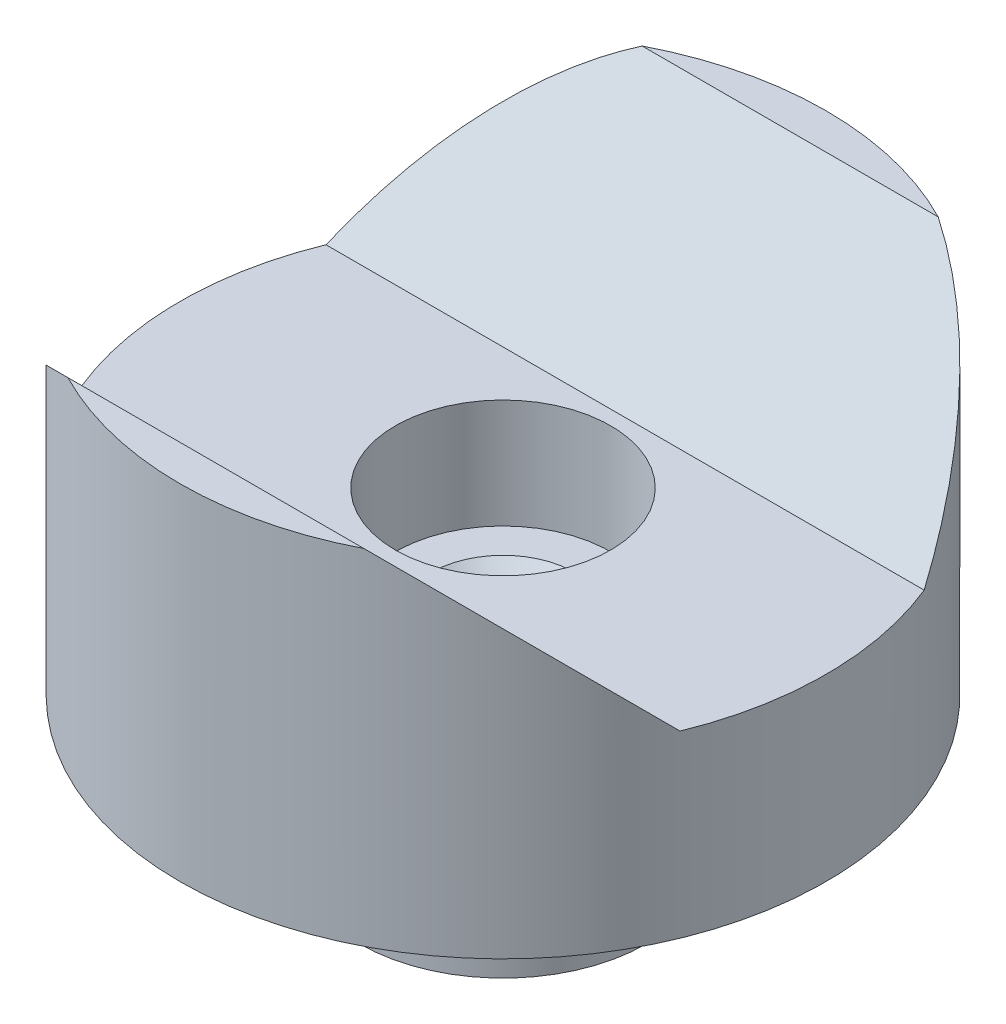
ISO-10303-21;
HEADER;
FILE_DESCRIPTION(('STEP AP214'),'2;1');
FILE_NAME('part.step','',(''),(''),'','','');
FILE_SCHEMA(('AUTOMOTIVE_DESIGN { 1 0 10303 214 1 1 1 1 }'));
ENDSEC;
DATA;
#1=APPLICATION_CONTEXT('core data for automotive mechanical design processes');
#2=APPLICATION_PROTOCOL_DEFINITION('international standard','automotive_design',2000,#1);
#3=PRODUCT_CONTEXT('',#1,'mechanical');
#4=PRODUCT('Part','Part','',(#3));
#5=PRODUCT_RELATED_PRODUCT_CATEGORY('part','',(#4));
#6=PRODUCT_DEFINITION_FORMATION('','',#4);
#7=PRODUCT_DEFINITION_CONTEXT('part definition',#1,'design');
#8=PRODUCT_DEFINITION('design','',#6,#7);
#9=PRODUCT_DEFINITION_SHAPE('','',#8);
#10=(LENGTH_UNIT() NAMED_UNIT(*) SI_UNIT(.MILLI.,.METRE.));
#11=(NAMED_UNIT(*) PLANE_ANGLE_UNIT() SI_UNIT($,.RADIAN.));
#12=(NAMED_UNIT(*) SI_UNIT($,.STERADIAN.) SOLID_ANGLE_UNIT());
#13=UNCERTAINTY_MEASURE_WITH_UNIT(LENGTH_MEASURE(1.E-05),#10,'distance_accuracy_value','');
#14=(GEOMETRIC_REPRESENTATION_CONTEXT(3) GLOBAL_UNCERTAINTY_ASSIGNED_CONTEXT((#13)) GLOBAL_UNIT_ASSIGNED_CONTEXT((#10,
#11,#12)) REPRESENTATION_CONTEXT('',''));
#15=CARTESIAN_POINT('',(0.,0.,0.));
#16=DIRECTION('',(0.,0.,1.));
#17=DIRECTION('',(1.,0.,0.));
#18=AXIS2_PLACEMENT_3D('',#15,#16,#17);
#19=CARTESIAN_POINT('',(-14.2875,7.9375,-5.3975));
#20=DIRECTION('',(0.,-1.,0.));
#21=DIRECTION('',(0.,0.,-1.));
#22=AXIS2_PLACEMENT_3D('',#19,#20,#21);
#23=PLANE('',#22);
#24=DIRECTION('',(1.,0.,0.));
#25=VECTOR('',#24,1.);
#26=CARTESIAN_POINT('',(-14.2875,7.9375,-5.3975));
#27=LINE('',#26,#25);
#28=CARTESIAN_POINT('',(-13.2287433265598,7.9375,-5.39749999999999));
#29=VERTEX_POINT('',#28);
#30=CARTESIAN_POINT('',(13.2287433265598,7.9375,-5.39749999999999));
#31=VERTEX_POINT('',#30);
#32=EDGE_CURVE('E146',#29,#31,#27,.T.);
#33=ORIENTED_EDGE('',*,*,#32,.F.);
#34=CARTESIAN_POINT('',(0.,7.9375,0.));
#35=DIRECTION('',(0.,-1.,0.));
#36=DIRECTION('',(0.,0.,-1.));
#37=AXIS2_PLACEMENT_3D('',#34,#35,#36);
#38=CIRCLE('',#37,14.2875);
#39=CARTESIAN_POINT('',(-13.2287433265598,7.9375,5.39749999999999));
#40=VERTEX_POINT('',#39);
#41=EDGE_CURVE('E96',#40,#29,#38,.T.);
#42=ORIENTED_EDGE('',*,*,#41,.F.);
#43=DIRECTION('',(1.,0.,0.));
#44=VECTOR('',#43,1.);
#45=CARTESIAN_POINT('',(-14.2875,7.9375,5.3975));
#46=LINE('',#45,#44);
#47=CARTESIAN_POINT('',(13.2287433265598,7.9375,5.39749999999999));
#48=VERTEX_POINT('',#47);
#49=EDGE_CURVE('E142',#40,#48,#46,.T.);
#50=ORIENTED_EDGE('',*,*,#49,.T.);
#51=EDGE_CURVE('E108',#31,#48,#38,.T.);
#52=ORIENTED_EDGE('',*,*,#51,.F.);
#53=EDGE_LOOP('',(#33,#42,#50,#52));
#54=FACE_BOUND('',#53,.T.);
#55=CARTESIAN_POINT('',(0.,7.9375,0.));
#56=DIRECTION('',(0.,1.,0.));
#57=DIRECTION('',(0.,0.,1.));
#58=AXIS2_PLACEMENT_3D('',#55,#56,#57);
#59=CIRCLE('',#58,4.7625);
#60=CARTESIAN_POINT('',(0.,7.9375,4.7625));
#61=VERTEX_POINT('',#60);
#62=EDGE_CURVE('E149',#61,#61,#59,.T.);
#63=ORIENTED_EDGE('',*,*,#62,.F.);
#64=EDGE_LOOP('',(#63));
#65=FACE_BOUND('',#64,.T.);
#66=ADVANCED_FACE('F43',(#54,#65),#23,.F.);
#67=CARTESIAN_POINT('',(0.,-6.35,0.));
#68=DIRECTION('',(0.,-1.,0.));
#69=DIRECTION('',(0.,0.,-1.));
#70=AXIS2_PLACEMENT_3D('',#67,#68,#69);
#71=PLANE('',#70);
#72=CARTESIAN_POINT('',(0.,-6.35,0.));
#73=DIRECTION('',(0.,-1.,0.));
#74=DIRECTION('',(0.,0.,-1.));
#75=AXIS2_PLACEMENT_3D('',#72,#73,#74);
#76=CIRCLE('',#75,3.175);
#77=CARTESIAN_POINT('',(0.,-6.35,-3.175));
#78=VERTEX_POINT('',#77);
#79=EDGE_CURVE('E114',#78,#78,#76,.F.);
#80=ORIENTED_EDGE('',*,*,#79,.T.);
#81=EDGE_LOOP('',(#80));
#82=FACE_BOUND('',#81,.T.);
#83=CARTESIAN_POINT('',(0.,-6.35,0.));
#84=DIRECTION('',(0.,-1.,0.));
#85=DIRECTION('',(0.,0.,-1.));
#86=AXIS2_PLACEMENT_3D('',#83,#84,#85);
#87=CIRCLE('',#86,6.35);
#88=CARTESIAN_POINT('',(0.,-6.35,-6.35));
#89=VERTEX_POINT('',#88);
#90=EDGE_CURVE('E140',#89,#89,#87,.T.);
#91=ORIENTED_EDGE('',*,*,#90,.T.);
#92=EDGE_LOOP('',(#91));
#93=FACE_BOUND('',#92,.T.);
#94=ADVANCED_FACE('F133',(#82,#93),#71,.T.);
#95=CARTESIAN_POINT('',(0.,0.,0.));
#96=DIRECTION('',(0.,1.,0.));
#97=DIRECTION('',(0.,0.,1.));
#98=AXIS2_PLACEMENT_3D('',#95,#96,#97);
#99=PLANE('',#98);
#100=CARTESIAN_POINT('',(0.,0.,0.));
#101=DIRECTION('',(0.,1.,0.));
#102=DIRECTION('',(0.,0.,1.));
#103=AXIS2_PLACEMENT_3D('',#100,#101,#102);
#104=CIRCLE('',#103,14.2875);
#105=CARTESIAN_POINT('',(0.,0.,14.2875));
#106=VERTEX_POINT('',#105);
#107=EDGE_CURVE('E103',#106,#106,#104,.T.);
#108=ORIENTED_EDGE('',*,*,#107,.F.);
#109=EDGE_LOOP('',(#108));
#110=FACE_BOUND('',#109,.T.);
#111=CARTESIAN_POINT('',(0.,0.,0.));
#112=DIRECTION('',(0.,1.,0.));
#113=DIRECTION('',(0.,0.,1.));
#114=AXIS2_PLACEMENT_3D('',#111,#112,#113);
#115=CIRCLE('',#114,6.35);
#116=CARTESIAN_POINT('',(0.,0.,6.35));
#117=VERTEX_POINT('',#116);
#118=EDGE_CURVE('E111',#117,#117,#115,.F.);
#119=ORIENTED_EDGE('',*,*,#118,.F.);
#120=EDGE_LOOP('',(#119));
#121=FACE_BOUND('',#120,.T.);
#122=ADVANCED_FACE('F136',(#110,#121),#99,.F.);
#123=CARTESIAN_POINT('',(0.,15.24,0.));
#124=DIRECTION('',(0.,1.,0.));
#125=DIRECTION('',(0.,0.,1.));
#126=AXIS2_PLACEMENT_3D('',#123,#124,#125);
#127=PLANE('',#126);
#128=DIRECTION('',(1.,0.,0.));
#129=VECTOR('',#128,1.);
#130=CARTESIAN_POINT('',(0.,15.24,12.7));
#131=LINE('',#130,#129);
#132=CARTESIAN_POINT('',(-6.54543018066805,15.24,12.7));
#133=VERTEX_POINT('',#132);
#134=CARTESIAN_POINT('',(6.54543018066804,15.24,12.7));
#135=VERTEX_POINT('',#134);
#136=EDGE_CURVE('E66',#133,#135,#131,.T.);
#137=ORIENTED_EDGE('',*,*,#136,.F.);
#138=CARTESIAN_POINT('',(0.,15.24,0.));
#139=DIRECTION('',(0.,1.,0.));
#140=DIRECTION('',(0.,0.,1.));
#141=AXIS2_PLACEMENT_3D('',#138,#139,#140);
#142=CIRCLE('',#141,14.2875);
#143=EDGE_CURVE('E100',#133,#135,#142,.T.);
#144=ORIENTED_EDGE('',*,*,#143,.T.);
#145=EDGE_LOOP('',(#137,#144));
#146=FACE_BOUND('',#145,.T.);
#147=ADVANCED_FACE('F160',(#146),#127,.T.);
#148=CARTESIAN_POINT('',(0.,15.24,0.));
#149=DIRECTION('',(0.,-1.,0.));
#150=DIRECTION('',(0.,0.,-1.));
#151=AXIS2_PLACEMENT_3D('',#148,#149,#150);
#152=CYLINDRICAL_SURFACE('',#151,14.2875);
#153=CARTESIAN_POINT('',(6.54543018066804,15.24,-12.7));
#154=VERTEX_POINT('',#153);
#155=CARTESIAN_POINT('',(-6.54543018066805,15.24,-12.7));
#156=VERTEX_POINT('',#155);
#157=EDGE_CURVE('E90',#154,#156,#142,.T.);
#158=ORIENTED_EDGE('',*,*,#157,.F.);
#159=CARTESIAN_POINT('',(0.,2.54000000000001,0.));
#160=DIRECTION('',(0.,-0.707106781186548,-0.707106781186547));
#161=DIRECTION('',(0.,-0.707106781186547,0.707106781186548));
#162=AXIS2_PLACEMENT_3D('',#159,#160,#161);
#163=ELLIPSE('',#162,20.2055762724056,14.2875);
#164=EDGE_CURVE('E58',#154,#31,#163,.T.);
#165=ORIENTED_EDGE('',*,*,#164,.T.);
#166=ORIENTED_EDGE('',*,*,#51,.T.);
#167=CARTESIAN_POINT('',(0.,2.54000000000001,0.));
#168=DIRECTION('',(0.,-0.707106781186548,0.707106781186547));
#169=DIRECTION('',(0.,-0.707106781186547,-0.707106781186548));
#170=AXIS2_PLACEMENT_3D('',#167,#168,#169);
#171=ELLIPSE('',#170,20.2055762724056,14.2875);
#172=EDGE_CURVE('E153',#48,#135,#171,.T.);
#173=ORIENTED_EDGE('',*,*,#172,.T.);
#174=ORIENTED_EDGE('',*,*,#143,.F.);
#175=EDGE_CURVE('E97',#133,#40,#171,.T.);
#176=ORIENTED_EDGE('',*,*,#175,.T.);
#177=ORIENTED_EDGE('',*,*,#41,.T.);
#178=EDGE_CURVE('E85',#29,#156,#163,.T.);
#179=ORIENTED_EDGE('',*,*,#178,.T.);
#180=EDGE_LOOP('',(#158,#165,#166,#173,#174,#176,#177,#179));
#181=FACE_BOUND('',#180,.T.);
#182=ORIENTED_EDGE('',*,*,#107,.T.);
#183=EDGE_LOOP('',(#182));
#184=FACE_BOUND('',#183,.T.);
#185=ADVANCED_FACE('F45',(#181,#184),#152,.T.);
#186=DIRECTION('',(-1.,0.,0.));
#187=VECTOR('',#186,1.);
#188=CARTESIAN_POINT('',(0.,15.24,-12.7));
#189=LINE('',#188,#187);
#190=EDGE_CURVE('E82',#154,#156,#189,.T.);
#191=ORIENTED_EDGE('',*,*,#190,.F.);
#192=ORIENTED_EDGE('',*,*,#157,.T.);
#193=EDGE_LOOP('',(#191,#192));
#194=FACE_BOUND('',#193,.T.);
#195=ADVANCED_FACE('F99',(#194),#127,.T.);
#196=CARTESIAN_POINT('',(-14.2875,7.9375,5.3975));
#197=DIRECTION('',(0.,-0.707106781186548,0.707106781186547));
#198=DIRECTION('',(0.,-0.707106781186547,-0.707106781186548));
#199=AXIS2_PLACEMENT_3D('',#196,#197,#198);
#200=PLANE('',#199);
#201=ORIENTED_EDGE('',*,*,#49,.F.);
#202=ORIENTED_EDGE('',*,*,#175,.F.);
#203=ORIENTED_EDGE('',*,*,#136,.T.);
#204=ORIENTED_EDGE('',*,*,#172,.F.);
#205=EDGE_LOOP('',(#201,#202,#203,#204));
#206=FACE_BOUND('',#205,.T.);
#207=ADVANCED_FACE('F174',(#206),#200,.F.);
#208=CARTESIAN_POINT('',(-14.2875,15.24,-12.7));
#209=DIRECTION('',(0.,-0.707106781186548,-0.707106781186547));
#210=DIRECTION('',(0.,0.707106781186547,-0.707106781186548));
#211=AXIS2_PLACEMENT_3D('',#208,#209,#210);
#212=PLANE('',#211);
#213=ORIENTED_EDGE('',*,*,#32,.T.);
#214=ORIENTED_EDGE('',*,*,#164,.F.);
#215=ORIENTED_EDGE('',*,*,#190,.T.);
#216=ORIENTED_EDGE('',*,*,#178,.F.);
#217=EDGE_LOOP('',(#213,#214,#215,#216));
#218=FACE_BOUND('',#217,.T.);
#219=ADVANCED_FACE('F84',(#218),#212,.F.);
#220=CARTESIAN_POINT('',(0.,-6.35,0.));
#221=DIRECTION('',(0.,1.,0.));
#222=DIRECTION('',(0.,0.,1.));
#223=AXIS2_PLACEMENT_3D('',#220,#221,#222);
#224=CYLINDRICAL_SURFACE('',#223,6.35);
#225=ORIENTED_EDGE('',*,*,#90,.F.);
#226=EDGE_LOOP('',(#225));
#227=FACE_BOUND('',#226,.T.);
#228=ORIENTED_EDGE('',*,*,#118,.T.);
#229=EDGE_LOOP('',(#228));
#230=FACE_BOUND('',#229,.T.);
#231=ADVANCED_FACE('F164',(#227,#230),#224,.T.);
#232=CARTESIAN_POINT('',(0.,13.9793934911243,0.));
#233=DIRECTION('',(0.,1.,0.));
#234=DIRECTION('',(0.,0.,1.));
#235=AXIS2_PLACEMENT_3D('',#232,#233,#234);
#236=CYLINDRICAL_SURFACE('',#235,2.5527);
#237=CARTESIAN_POINT('',(0.,-5.7277,0.));
#238=DIRECTION('',(0.,-1.,0.));
#239=DIRECTION('',(0.,0.,-1.));
#240=AXIS2_PLACEMENT_3D('',#237,#238,#239);
#241=CIRCLE('',#240,2.5527);
#242=CARTESIAN_POINT('',(0.,-5.7277,-2.5527));
#243=VERTEX_POINT('',#242);
#244=EDGE_CURVE('E51',#243,#243,#241,.T.);
#245=ORIENTED_EDGE('',*,*,#244,.T.);
#246=EDGE_LOOP('',(#245));
#247=FACE_BOUND('',#246,.T.);
#248=CARTESIAN_POINT('',(0.,2.4892,0.));
#249=DIRECTION('',(0.,1.,0.));
#250=DIRECTION('',(0.,0.,1.));
#251=AXIS2_PLACEMENT_3D('',#248,#249,#250);
#252=CIRCLE('',#251,2.5527);
#253=CARTESIAN_POINT('',(0.,2.4892,2.5527));
#254=VERTEX_POINT('',#253);
#255=EDGE_CURVE('E117',#254,#254,#252,.T.);
#256=ORIENTED_EDGE('',*,*,#255,.T.);
#257=EDGE_LOOP('',(#256));
#258=FACE_BOUND('',#257,.T.);
#259=ADVANCED_FACE('F122',(#247,#258),#236,.F.);
#260=CARTESIAN_POINT('',(2.5527,3.1115,0.));
#261=DIRECTION('',(0.,1.,0.));
#262=DIRECTION('',(0.,0.,1.));
#263=AXIS2_PLACEMENT_3D('',#260,#261,#262);
#264=PLANE('',#263);
#265=CARTESIAN_POINT('',(0.,3.1115,0.));
#266=DIRECTION('',(0.,1.,0.));
#267=DIRECTION('',(0.,0.,1.));
#268=AXIS2_PLACEMENT_3D('',#265,#266,#267);
#269=CIRCLE('',#268,3.175);
#270=CARTESIAN_POINT('',(0.,3.1115,3.175));
#271=VERTEX_POINT('',#270);
#272=EDGE_CURVE('E13',#271,#271,#269,.F.);
#273=ORIENTED_EDGE('',*,*,#272,.T.);
#274=EDGE_LOOP('',(#273));
#275=FACE_BOUND('',#274,.T.);
#276=CARTESIAN_POINT('',(0.,3.1115,0.));
#277=DIRECTION('',(0.,1.,0.));
#278=DIRECTION('',(0.,0.,1.));
#279=AXIS2_PLACEMENT_3D('',#276,#277,#278);
#280=CIRCLE('',#279,4.7625);
#281=CARTESIAN_POINT('',(0.,3.1115,4.7625));
#282=VERTEX_POINT('',#281);
#283=EDGE_CURVE('E143',#282,#282,#280,.T.);
#284=ORIENTED_EDGE('',*,*,#283,.T.);
#285=EDGE_LOOP('',(#284));
#286=FACE_BOUND('',#285,.T.);
#287=ADVANCED_FACE('F171',(#275,#286),#264,.T.);
#288=CARTESIAN_POINT('',(0.,13.9793934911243,0.));
#289=DIRECTION('',(0.,1.,0.));
#290=DIRECTION('',(0.,0.,1.));
#291=AXIS2_PLACEMENT_3D('',#288,#289,#290);
#292=CYLINDRICAL_SURFACE('',#291,4.7625);
#293=ORIENTED_EDGE('',*,*,#62,.T.);
#294=EDGE_LOOP('',(#293));
#295=FACE_BOUND('',#294,.T.);
#296=ORIENTED_EDGE('',*,*,#283,.F.);
#297=EDGE_LOOP('',(#296));
#298=FACE_BOUND('',#297,.T.);
#299=ADVANCED_FACE('F129',(#295,#298),#292,.F.);
#300=CARTESIAN_POINT('',(0.,-6.35,0.));
#301=DIRECTION('',(0.,-1.,0.));
#302=DIRECTION('',(0.,0.,-1.));
#303=AXIS2_PLACEMENT_3D('',#300,#301,#302);
#304=CONICAL_SURFACE('',#303,3.175,0.785398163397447);
#305=ORIENTED_EDGE('',*,*,#244,.F.);
#306=EDGE_LOOP('',(#305));
#307=FACE_BOUND('',#306,.T.);
#308=ORIENTED_EDGE('',*,*,#79,.F.);
#309=EDGE_LOOP('',(#308));
#310=FACE_BOUND('',#309,.T.);
#311=ADVANCED_FACE('F125',(#307,#310),#304,.F.);
#312=CARTESIAN_POINT('',(0.,2.4892,0.));
#313=DIRECTION('',(0.,1.,0.));
#314=DIRECTION('',(0.,0.,1.));
#315=AXIS2_PLACEMENT_3D('',#312,#313,#314);
#316=CONICAL_SURFACE('',#315,2.5527,0.785398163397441);
#317=ORIENTED_EDGE('',*,*,#272,.F.);
#318=EDGE_LOOP('',(#317));
#319=FACE_BOUND('',#318,.T.);
#320=ORIENTED_EDGE('',*,*,#255,.F.);
#321=EDGE_LOOP('',(#320));
#322=FACE_BOUND('',#321,.T.);
#323=ADVANCED_FACE('F128',(#319,#322),#316,.F.);
#324=CLOSED_SHELL('',(#66,#94,#122,#147,#185,#195,#207,#219,#231,#259,#287,#299,#311,#323));
#325=MANIFOLD_SOLID_BREP('B2',#324);
#326=ADVANCED_BREP_SHAPE_REPRESENTATION('',(#18,#325),#14);
#327=SHAPE_DEFINITION_REPRESENTATION(#9,#326);
ENDSEC;
END-ISO-10303-21;
